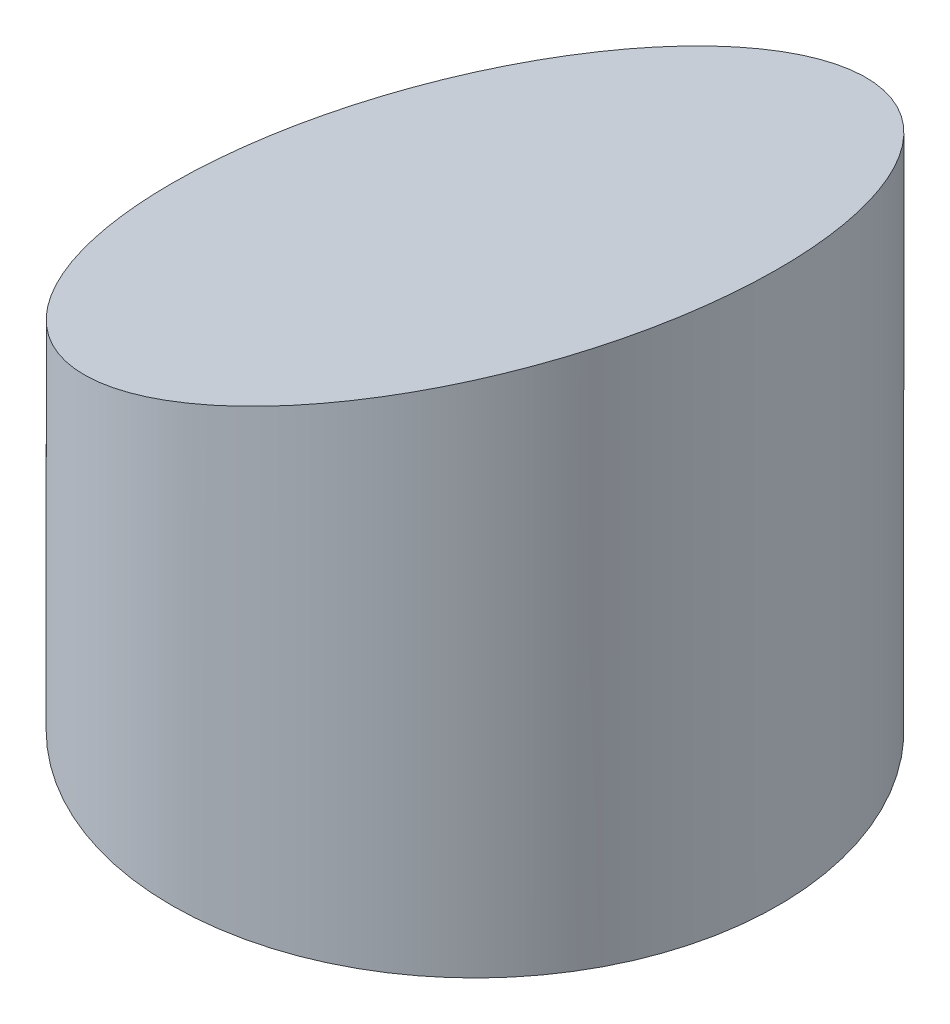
from build123d import *

# Parameters (mm, degrees)
SKIZZE1_R               = 42.776907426
LINEAR_AUSTRAGEN1_DEPTH = 100


with BuildPart() as part:
    # Skizze1 → Linear austragen1 (new body)
    with BuildSketch(Plane(origin=(0, 0, 0), x_dir=(1, 0, 0), z_dir=(0, 1, 0))):
        with Locations(Location((0, 0, 0), (0, 0, 270))):
            Circle(SKIZZE1_R)
    extrude(amount=LINEAR_AUSTRAGEN1_DEPTH)

    # Oberfl_chenschnitt1
    split(bisect_by=Plane(origin=(-20.374998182, 53.902513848, 0), x_dir=(0.9354042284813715, 0.3535801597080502, 1.319770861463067e-15), z_dir=(0.3535801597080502, -0.9354042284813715, -3.491483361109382e-15)), keep=Keep.TOP)


solid = part.part
